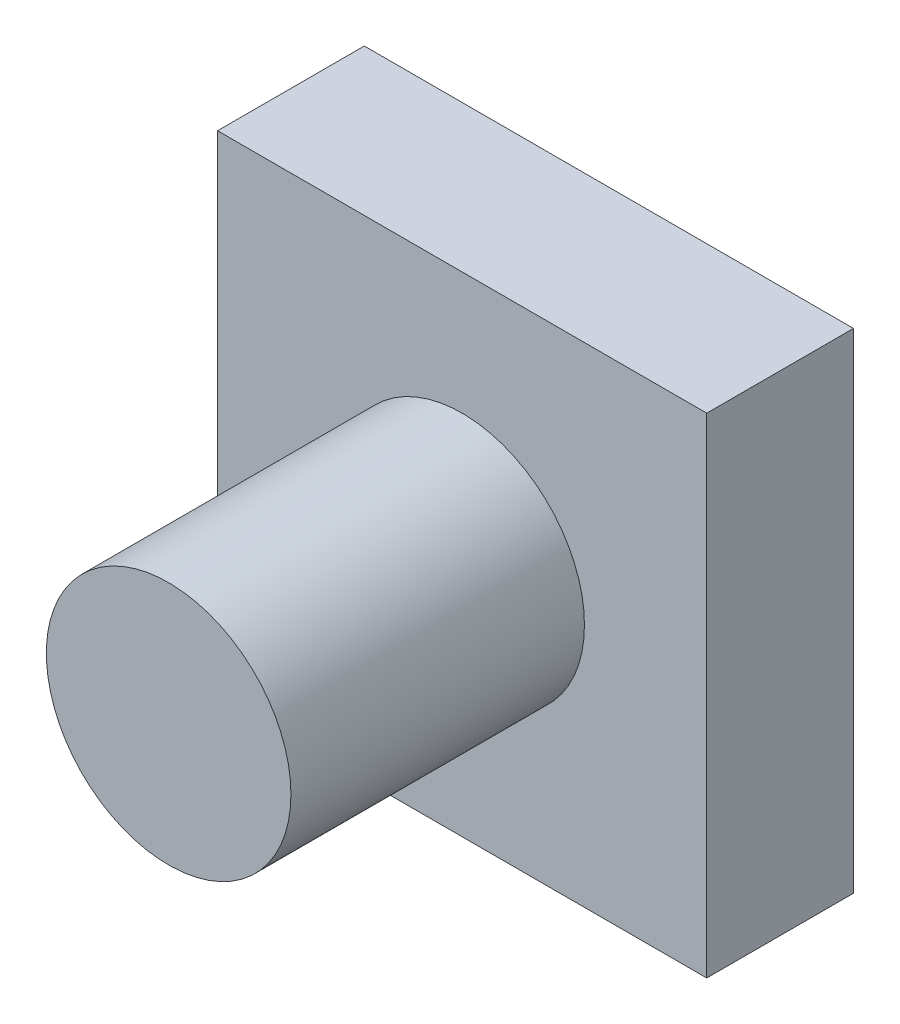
from build123d import *

# Parameters (mm, degrees)
ESQUISSE1_W        = 500
ESQUISSE1_H        = 500
BOSS_EXTRU_1_DEPTH = 150
ESQUISSE2_R        = 125
BOSS_EXTRU_2_DEPTH = 300


with BuildPart() as part:
    # Esquisse1 → Boss.-Extru.1 (new body)
    with BuildSketch(Plane.XY):
        Rectangle(ESQUISSE1_W, ESQUISSE1_H)
    extrude(amount=BOSS_EXTRU_1_DEPTH)

    # Esquisse2 → Boss.-Extru.2 (add)
    with BuildSketch(Plane.XY.offset(150)):
        Circle(ESQUISSE2_R)
    extrude(amount=BOSS_EXTRU_2_DEPTH)


solid = part.part
